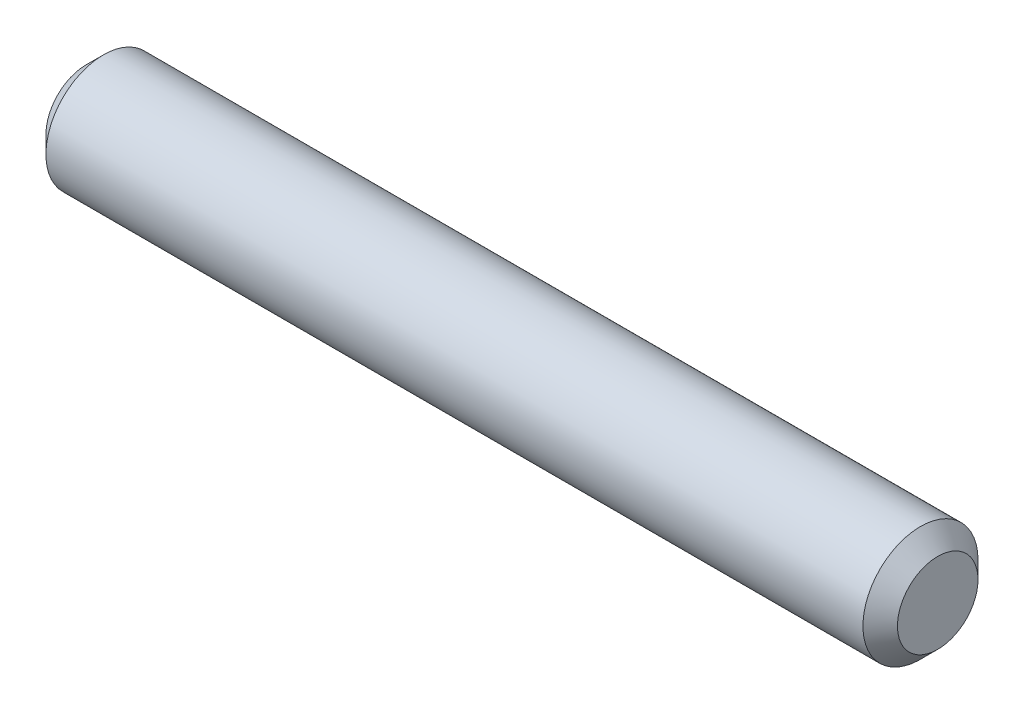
from build123d import *


with BuildPart() as part:
    # Sketch1 → Revolve1 (revolve)
    with BuildSketch(Plane.XY, mode=Mode.PRIVATE) as revolve1_sk:
        Polygon((-7.4, 0.699994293), (-7.4, 0), (7.4, 0), (7.4, 0.699994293), (7.099991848, 1), (-7.099991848, 1), align=None)
    revolve(revolve1_sk.sketch.rotate(Axis((-7.4, 0, 0), (1, 0, 0)), 270), axis=Axis((-7.4, 0, 0), (1, 0, 0)))


solid = part.part
